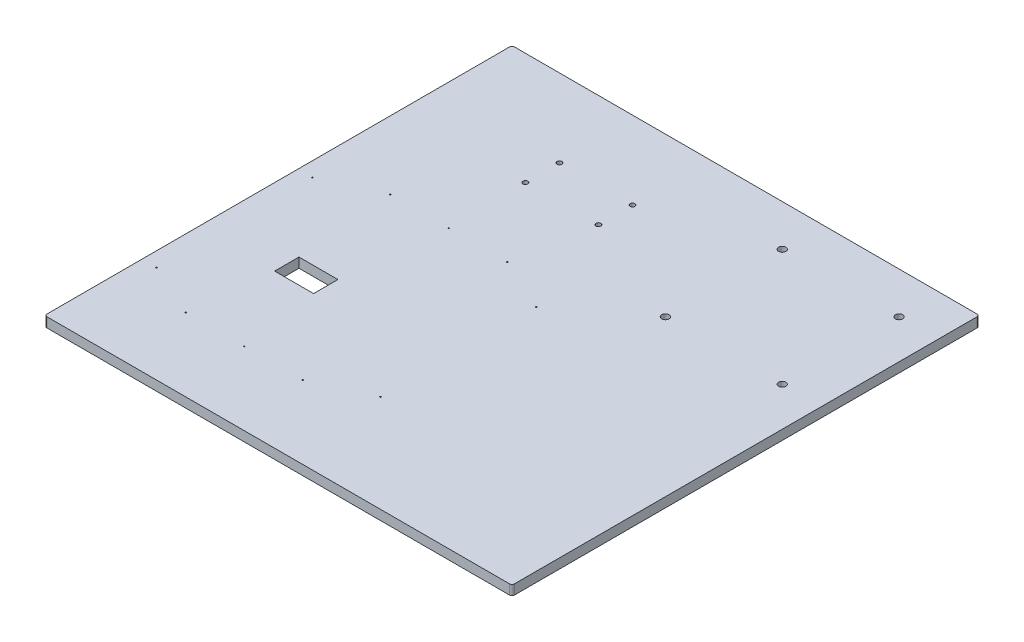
from build123d import *

# Parameters (mm, degrees)
SKETCH1_W                      = 609.6
SKETCH1_H                      = 609.6
SKETCH1_W_2                    = 50.799993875
SKETCH1_H_2                    = 31.75
BOSS_EXTRUDE1_DEPTH            = 12.7
FILLET7_R                      = 3.175
F_1_16_0_0625_DIAMETER_HOLE1_D = 1.5875
F_3_8_0_375_DIAMETER_HOLE1_D   = 9.525
F_1_4_0_25_DIAMETER_HOLE1_D    = 6.35


with BuildPart() as part:
    # Sketch1 → Boss-Extrude1 (new body)
    with BuildSketch(Plane(origin=(0, 0, 0), x_dir=(1, 0, 0), z_dir=(0, 1, 0))):
        with Locations((304.8, 304.8)):
            Rectangle(SKETCH1_W, SKETCH1_H)
        with Locations((125.39770869, 215.899999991)):
            Rectangle(SKETCH1_W_2, SKETCH1_H_2, mode=Mode.SUBTRACT)
    extrude(amount=BOSS_EXTRUDE1_DEPTH)

    # Fillet7
    fillet7_edges = [part.edges().sort_by_distance(p)[0] for p in [
        (0, 6.35, -609.6),
        (609.6, 6.35, -609.6),
        (609.6, 6.35, 0),
        (0, 6.35, 0),
    ]]
    fillet(fillet7_edges, radius=FILLET7_R)

    # 1_16 _0.0625_ Diameter Hole1 (through all)
    with Locations(Plane(origin=(0, 12.7, 0), x_dir=(1, 0, 0), z_dir=(0, 1, 0))):
        with Locations((19.05, 127), (88.9, 95.25), (165.1, 95.25), (241.3, 95.25), (311.15, 127), (311.15, 330.2), (241.3, 361.95), (165.1, 361.95), (88.9, 361.95), (19.05, 330.2)):
            Hole(F_1_16_0_0625_DIAMETER_HOLE1_D / 2)

    # 3_8 _0.375_ Diameter Hole1 (through all)
    with Locations(Plane(origin=(0, 12.7, 0), x_dir=(1, 0, 0), z_dir=(0, 1, 0))):
        with Locations((558.8, 555.625), (558.8, 403.225), (406.4, 403.225), (406.4, 555.625)):
            Hole(F_3_8_0_375_DIAMETER_HOLE1_D / 2)

    # 1_4 _0.25_ Diameter Hole1 (through all)
    with Locations(Plane(origin=(0, 12.7, 0), x_dir=(1, 0, 0), z_dir=(0, 1, 0))):
        with Locations((258.7625, 463.55), (163.5125, 463.55), (163.5125, 508), (258.7625, 508)):
            Hole(F_1_4_0_25_DIAMETER_HOLE1_D / 2)


solid = part.part
